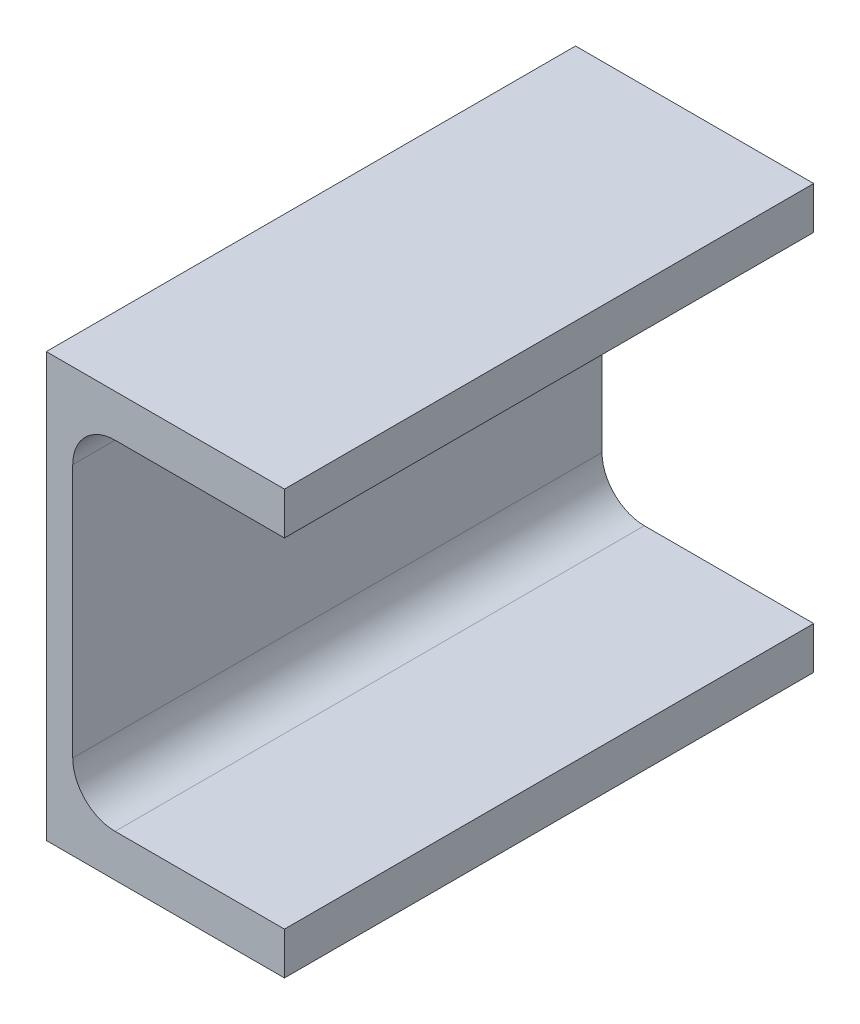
ISO-10303-21;
HEADER;
FILE_DESCRIPTION(('STEP AP214'),'2;1');
FILE_NAME('part.step','',(''),(''),'','','');
FILE_SCHEMA(('AUTOMOTIVE_DESIGN { 1 0 10303 214 1 1 1 1 }'));
ENDSEC;
DATA;
#1=APPLICATION_CONTEXT('core data for automotive mechanical design processes');
#2=APPLICATION_PROTOCOL_DEFINITION('international standard','automotive_design',2000,#1);
#3=PRODUCT_CONTEXT('',#1,'mechanical');
#4=PRODUCT('Part','Part','',(#3));
#5=PRODUCT_RELATED_PRODUCT_CATEGORY('part','',(#4));
#6=PRODUCT_DEFINITION_FORMATION('','',#4);
#7=PRODUCT_DEFINITION_CONTEXT('part definition',#1,'design');
#8=PRODUCT_DEFINITION('design','',#6,#7);
#9=PRODUCT_DEFINITION_SHAPE('','',#8);
#10=(LENGTH_UNIT() NAMED_UNIT(*) SI_UNIT(.MILLI.,.METRE.));
#11=(NAMED_UNIT(*) PLANE_ANGLE_UNIT() SI_UNIT($,.RADIAN.));
#12=(NAMED_UNIT(*) SI_UNIT($,.STERADIAN.) SOLID_ANGLE_UNIT());
#13=UNCERTAINTY_MEASURE_WITH_UNIT(LENGTH_MEASURE(1.E-05),#10,'distance_accuracy_value','');
#14=(GEOMETRIC_REPRESENTATION_CONTEXT(3) GLOBAL_UNCERTAINTY_ASSIGNED_CONTEXT((#13)) GLOBAL_UNIT_ASSIGNED_CONTEXT((#10,
#11,#12)) REPRESENTATION_CONTEXT('',''));
#15=CARTESIAN_POINT('',(0.,0.,0.));
#16=DIRECTION('',(0.,0.,1.));
#17=DIRECTION('',(1.,0.,0.));
#18=AXIS2_PLACEMENT_3D('',#15,#16,#17);
#19=CARTESIAN_POINT('',(0.,40.,50.));
#20=DIRECTION('',(1.,0.,0.));
#21=DIRECTION('',(0.,1.,0.));
#22=AXIS2_PLACEMENT_3D('',#19,#20,#21);
#23=PLANE('',#22);
#24=DIRECTION('',(0.,-1.,0.));
#25=VECTOR('',#24,1.);
#26=CARTESIAN_POINT('',(0.,40.,-50.));
#27=LINE('',#26,#25);
#28=CARTESIAN_POINT('',(0.,40.,-50.));
#29=VERTEX_POINT('',#28);
#30=CARTESIAN_POINT('',(0.,-40.,-50.));
#31=VERTEX_POINT('',#30);
#32=EDGE_CURVE('E140',#29,#31,#27,.T.);
#33=ORIENTED_EDGE('',*,*,#32,.T.);
#34=DIRECTION('',(0.,0.,-1.));
#35=VECTOR('',#34,1.);
#36=CARTESIAN_POINT('',(0.,-40.,50.));
#37=LINE('',#36,#35);
#38=CARTESIAN_POINT('',(0.,-40.,50.));
#39=VERTEX_POINT('',#38);
#40=EDGE_CURVE('E11',#39,#31,#37,.T.);
#41=ORIENTED_EDGE('',*,*,#40,.F.);
#42=DIRECTION('',(0.,-1.,0.));
#43=VECTOR('',#42,1.);
#44=CARTESIAN_POINT('',(0.,40.,50.));
#45=LINE('',#44,#43);
#46=CARTESIAN_POINT('',(0.,40.,50.));
#47=VERTEX_POINT('',#46);
#48=EDGE_CURVE('E158',#47,#39,#45,.T.);
#49=ORIENTED_EDGE('',*,*,#48,.F.);
#50=DIRECTION('',(0.,0.,-1.));
#51=VECTOR('',#50,1.);
#52=CARTESIAN_POINT('',(0.,40.,50.));
#53=LINE('',#52,#51);
#54=EDGE_CURVE('E136',#47,#29,#53,.T.);
#55=ORIENTED_EDGE('',*,*,#54,.T.);
#56=EDGE_LOOP('',(#33,#41,#49,#55));
#57=FACE_BOUND('',#56,.T.);
#58=ADVANCED_FACE('F32',(#57),#23,.F.);
#59=CARTESIAN_POINT('',(45.,-40.,50.));
#60=DIRECTION('',(0.,1.,0.));
#61=DIRECTION('',(-1.,0.,0.));
#62=AXIS2_PLACEMENT_3D('',#59,#60,#61);
#63=PLANE('',#62);
#64=DIRECTION('',(1.,0.,0.));
#65=VECTOR('',#64,1.);
#66=CARTESIAN_POINT('',(45.,-40.,-50.));
#67=LINE('',#66,#65);
#68=CARTESIAN_POINT('',(45.,-40.,-50.));
#69=VERTEX_POINT('',#68);
#70=EDGE_CURVE('E143',#31,#69,#67,.T.);
#71=ORIENTED_EDGE('',*,*,#70,.T.);
#72=DIRECTION('',(0.,0.,-1.));
#73=VECTOR('',#72,1.);
#74=CARTESIAN_POINT('',(45.,-40.,50.));
#75=LINE('',#74,#73);
#76=CARTESIAN_POINT('',(45.,-40.,50.));
#77=VERTEX_POINT('',#76);
#78=EDGE_CURVE('E40',#77,#69,#75,.T.);
#79=ORIENTED_EDGE('',*,*,#78,.F.);
#80=DIRECTION('',(1.,0.,0.));
#81=VECTOR('',#80,1.);
#82=CARTESIAN_POINT('',(45.,-40.,50.));
#83=LINE('',#82,#81);
#84=EDGE_CURVE('E97',#39,#77,#83,.T.);
#85=ORIENTED_EDGE('',*,*,#84,.F.);
#86=ORIENTED_EDGE('',*,*,#40,.T.);
#87=EDGE_LOOP('',(#71,#79,#85,#86));
#88=FACE_BOUND('',#87,.T.);
#89=ADVANCED_FACE('F207',(#88),#63,.F.);
#90=CARTESIAN_POINT('',(45.,-32.,50.));
#91=DIRECTION('',(-1.,0.,0.));
#92=DIRECTION('',(0.,-1.,0.));
#93=AXIS2_PLACEMENT_3D('',#90,#91,#92);
#94=PLANE('',#93);
#95=DIRECTION('',(0.,1.,0.));
#96=VECTOR('',#95,1.);
#97=CARTESIAN_POINT('',(45.,-32.,-50.));
#98=LINE('',#97,#96);
#99=CARTESIAN_POINT('',(45.,-32.,-50.));
#100=VERTEX_POINT('',#99);
#101=EDGE_CURVE('E145',#69,#100,#98,.T.);
#102=ORIENTED_EDGE('',*,*,#101,.T.);
#103=DIRECTION('',(0.,0.,-1.));
#104=VECTOR('',#103,1.);
#105=CARTESIAN_POINT('',(45.,-32.,50.));
#106=LINE('',#105,#104);
#107=CARTESIAN_POINT('',(45.,-32.,50.));
#108=VERTEX_POINT('',#107);
#109=EDGE_CURVE('E171',#108,#100,#106,.T.);
#110=ORIENTED_EDGE('',*,*,#109,.F.);
#111=DIRECTION('',(0.,1.,0.));
#112=VECTOR('',#111,1.);
#113=CARTESIAN_POINT('',(45.,-32.,50.));
#114=LINE('',#113,#112);
#115=EDGE_CURVE('E179',#77,#108,#114,.T.);
#116=ORIENTED_EDGE('',*,*,#115,.F.);
#117=ORIENTED_EDGE('',*,*,#78,.T.);
#118=EDGE_LOOP('',(#102,#110,#116,#117));
#119=FACE_BOUND('',#118,.T.);
#120=ADVANCED_FACE('F177',(#119),#94,.F.);
#121=CARTESIAN_POINT('',(13.,-32.,50.));
#122=DIRECTION('',(0.,-1.,0.));
#123=DIRECTION('',(0.,0.,-1.));
#124=AXIS2_PLACEMENT_3D('',#121,#122,#123);
#125=PLANE('',#124);
#126=DIRECTION('',(-1.,0.,0.));
#127=VECTOR('',#126,1.);
#128=CARTESIAN_POINT('',(13.,-32.,-50.));
#129=LINE('',#128,#127);
#130=CARTESIAN_POINT('',(13.,-32.,-50.));
#131=VERTEX_POINT('',#130);
#132=EDGE_CURVE('E147',#100,#131,#129,.T.);
#133=ORIENTED_EDGE('',*,*,#132,.T.);
#134=DIRECTION('',(0.,0.,-1.));
#135=VECTOR('',#134,1.);
#136=CARTESIAN_POINT('',(13.,-32.,50.));
#137=LINE('',#136,#135);
#138=CARTESIAN_POINT('',(13.,-32.,50.));
#139=VERTEX_POINT('',#138);
#140=EDGE_CURVE('E168',#139,#131,#137,.T.);
#141=ORIENTED_EDGE('',*,*,#140,.F.);
#142=DIRECTION('',(-1.,0.,0.));
#143=VECTOR('',#142,1.);
#144=CARTESIAN_POINT('',(13.,-32.,50.));
#145=LINE('',#144,#143);
#146=EDGE_CURVE('E197',#108,#139,#145,.T.);
#147=ORIENTED_EDGE('',*,*,#146,.F.);
#148=ORIENTED_EDGE('',*,*,#109,.T.);
#149=EDGE_LOOP('',(#133,#141,#147,#148));
#150=FACE_BOUND('',#149,.T.);
#151=ADVANCED_FACE('F188',(#150),#125,.F.);
#152=CARTESIAN_POINT('',(13.,-24.,50.));
#153=DIRECTION('',(0.,0.,-1.));
#154=DIRECTION('',(-1.,0.,0.));
#155=AXIS2_PLACEMENT_3D('',#152,#153,#154);
#156=CYLINDRICAL_SURFACE('',#155,8.);
#157=CARTESIAN_POINT('',(13.,-24.,-50.));
#158=DIRECTION('',(0.,0.,-1.));
#159=DIRECTION('',(1.,0.,0.));
#160=AXIS2_PLACEMENT_3D('',#157,#158,#159);
#161=CIRCLE('',#160,8.);
#162=CARTESIAN_POINT('',(5.00000000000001,-24.,-50.));
#163=VERTEX_POINT('',#162);
#164=EDGE_CURVE('E149',#131,#163,#161,.T.);
#165=ORIENTED_EDGE('',*,*,#164,.T.);
#166=DIRECTION('',(0.,0.,-1.));
#167=VECTOR('',#166,1.);
#168=CARTESIAN_POINT('',(5.00000000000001,-24.,50.));
#169=LINE('',#168,#167);
#170=CARTESIAN_POINT('',(5.00000000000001,-24.,50.));
#171=VERTEX_POINT('',#170);
#172=EDGE_CURVE('E165',#171,#163,#169,.T.);
#173=ORIENTED_EDGE('',*,*,#172,.F.);
#174=CARTESIAN_POINT('',(13.,-24.,50.));
#175=DIRECTION('',(0.,0.,-1.));
#176=DIRECTION('',(1.,0.,0.));
#177=AXIS2_PLACEMENT_3D('',#174,#175,#176);
#178=CIRCLE('',#177,8.);
#179=EDGE_CURVE('E194',#139,#171,#178,.T.);
#180=ORIENTED_EDGE('',*,*,#179,.F.);
#181=ORIENTED_EDGE('',*,*,#140,.T.);
#182=EDGE_LOOP('',(#165,#173,#180,#181));
#183=FACE_BOUND('',#182,.T.);
#184=ADVANCED_FACE('F192',(#183),#156,.F.);
#185=CARTESIAN_POINT('',(4.99999999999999,24.,50.));
#186=DIRECTION('',(-1.,0.,0.));
#187=DIRECTION('',(0.,-1.,0.));
#188=AXIS2_PLACEMENT_3D('',#185,#186,#187);
#189=PLANE('',#188);
#190=DIRECTION('',(0.,1.,0.));
#191=VECTOR('',#190,1.);
#192=CARTESIAN_POINT('',(4.99999999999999,24.,-50.));
#193=LINE('',#192,#191);
#194=CARTESIAN_POINT('',(4.99999999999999,24.,-50.));
#195=VERTEX_POINT('',#194);
#196=EDGE_CURVE('E151',#163,#195,#193,.T.);
#197=ORIENTED_EDGE('',*,*,#196,.T.);
#198=DIRECTION('',(0.,0.,-1.));
#199=VECTOR('',#198,1.);
#200=CARTESIAN_POINT('',(4.99999999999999,24.,50.));
#201=LINE('',#200,#199);
#202=CARTESIAN_POINT('',(4.99999999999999,24.,50.));
#203=VERTEX_POINT('',#202);
#204=EDGE_CURVE('E162',#203,#195,#201,.T.);
#205=ORIENTED_EDGE('',*,*,#204,.F.);
#206=DIRECTION('',(0.,1.,0.));
#207=VECTOR('',#206,1.);
#208=CARTESIAN_POINT('',(4.99999999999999,24.,50.));
#209=LINE('',#208,#207);
#210=EDGE_CURVE('E196',#171,#203,#209,.T.);
#211=ORIENTED_EDGE('',*,*,#210,.F.);
#212=ORIENTED_EDGE('',*,*,#172,.T.);
#213=EDGE_LOOP('',(#197,#205,#211,#212));
#214=FACE_BOUND('',#213,.T.);
#215=ADVANCED_FACE('F219',(#214),#189,.F.);
#216=CARTESIAN_POINT('',(13.,24.,50.));
#217=DIRECTION('',(0.,0.,-1.));
#218=DIRECTION('',(-1.,0.,0.));
#219=AXIS2_PLACEMENT_3D('',#216,#217,#218);
#220=CYLINDRICAL_SURFACE('',#219,8.);
#221=CARTESIAN_POINT('',(13.,24.,-50.));
#222=DIRECTION('',(0.,0.,-1.));
#223=DIRECTION('',(-1.,0.,0.));
#224=AXIS2_PLACEMENT_3D('',#221,#222,#223);
#225=CIRCLE('',#224,8.);
#226=CARTESIAN_POINT('',(13.,32.,-50.));
#227=VERTEX_POINT('',#226);
#228=EDGE_CURVE('E153',#195,#227,#225,.T.);
#229=ORIENTED_EDGE('',*,*,#228,.T.);
#230=DIRECTION('',(0.,0.,-1.));
#231=VECTOR('',#230,1.);
#232=CARTESIAN_POINT('',(13.,32.,50.));
#233=LINE('',#232,#231);
#234=CARTESIAN_POINT('',(13.,32.,50.));
#235=VERTEX_POINT('',#234);
#236=EDGE_CURVE('E131',#235,#227,#233,.T.);
#237=ORIENTED_EDGE('',*,*,#236,.F.);
#238=CARTESIAN_POINT('',(13.,24.,50.));
#239=DIRECTION('',(0.,0.,-1.));
#240=DIRECTION('',(-1.,0.,0.));
#241=AXIS2_PLACEMENT_3D('',#238,#239,#240);
#242=CIRCLE('',#241,8.);
#243=EDGE_CURVE('E122',#203,#235,#242,.T.);
#244=ORIENTED_EDGE('',*,*,#243,.F.);
#245=ORIENTED_EDGE('',*,*,#204,.T.);
#246=EDGE_LOOP('',(#229,#237,#244,#245));
#247=FACE_BOUND('',#246,.T.);
#248=ADVANCED_FACE('F222',(#247),#220,.F.);
#249=CARTESIAN_POINT('',(13.,32.,50.));
#250=DIRECTION('',(0.,1.,0.));
#251=DIRECTION('',(-1.,0.,0.));
#252=AXIS2_PLACEMENT_3D('',#249,#250,#251);
#253=PLANE('',#252);
#254=DIRECTION('',(1.,0.,0.));
#255=VECTOR('',#254,1.);
#256=CARTESIAN_POINT('',(13.,32.,-50.));
#257=LINE('',#256,#255);
#258=CARTESIAN_POINT('',(45.,32.,-50.));
#259=VERTEX_POINT('',#258);
#260=EDGE_CURVE('E130',#227,#259,#257,.T.);
#261=ORIENTED_EDGE('',*,*,#260,.T.);
#262=DIRECTION('',(0.,0.,-1.));
#263=VECTOR('',#262,1.);
#264=CARTESIAN_POINT('',(45.,32.,50.));
#265=LINE('',#264,#263);
#266=CARTESIAN_POINT('',(45.,32.,50.));
#267=VERTEX_POINT('',#266);
#268=EDGE_CURVE('E127',#267,#259,#265,.T.);
#269=ORIENTED_EDGE('',*,*,#268,.F.);
#270=DIRECTION('',(1.,0.,0.));
#271=VECTOR('',#270,1.);
#272=CARTESIAN_POINT('',(13.,32.,50.));
#273=LINE('',#272,#271);
#274=EDGE_CURVE('E116',#235,#267,#273,.T.);
#275=ORIENTED_EDGE('',*,*,#274,.F.);
#276=ORIENTED_EDGE('',*,*,#236,.T.);
#277=EDGE_LOOP('',(#261,#269,#275,#276));
#278=FACE_BOUND('',#277,.T.);
#279=ADVANCED_FACE('F128',(#278),#253,.F.);
#280=CARTESIAN_POINT('',(45.,40.,50.));
#281=DIRECTION('',(-1.,0.,0.));
#282=DIRECTION('',(0.,0.,1.));
#283=AXIS2_PLACEMENT_3D('',#280,#281,#282);
#284=PLANE('',#283);
#285=DIRECTION('',(0.,1.,0.));
#286=VECTOR('',#285,1.);
#287=CARTESIAN_POINT('',(45.,40.,-50.));
#288=LINE('',#287,#286);
#289=CARTESIAN_POINT('',(45.,40.,-50.));
#290=VERTEX_POINT('',#289);
#291=EDGE_CURVE('E83',#259,#290,#288,.T.);
#292=ORIENTED_EDGE('',*,*,#291,.T.);
#293=DIRECTION('',(0.,0.,-1.));
#294=VECTOR('',#293,1.);
#295=CARTESIAN_POINT('',(45.,40.,50.));
#296=LINE('',#295,#294);
#297=CARTESIAN_POINT('',(45.,40.,50.));
#298=VERTEX_POINT('',#297);
#299=EDGE_CURVE('E132',#298,#290,#296,.T.);
#300=ORIENTED_EDGE('',*,*,#299,.F.);
#301=DIRECTION('',(0.,1.,0.));
#302=VECTOR('',#301,1.);
#303=CARTESIAN_POINT('',(45.,40.,50.));
#304=LINE('',#303,#302);
#305=EDGE_CURVE('E120',#267,#298,#304,.T.);
#306=ORIENTED_EDGE('',*,*,#305,.F.);
#307=ORIENTED_EDGE('',*,*,#268,.T.);
#308=EDGE_LOOP('',(#292,#300,#306,#307));
#309=FACE_BOUND('',#308,.T.);
#310=ADVANCED_FACE('F134',(#309),#284,.F.);
#311=CARTESIAN_POINT('',(45.,40.,50.));
#312=DIRECTION('',(0.,-1.,0.));
#313=DIRECTION('',(1.,0.,0.));
#314=AXIS2_PLACEMENT_3D('',#311,#312,#313);
#315=PLANE('',#314);
#316=DIRECTION('',(-1.,0.,0.));
#317=VECTOR('',#316,1.);
#318=CARTESIAN_POINT('',(45.,40.,-50.));
#319=LINE('',#318,#317);
#320=EDGE_CURVE('E89',#290,#29,#319,.T.);
#321=ORIENTED_EDGE('',*,*,#320,.T.);
#322=ORIENTED_EDGE('',*,*,#54,.F.);
#323=DIRECTION('',(-1.,0.,0.));
#324=VECTOR('',#323,1.);
#325=CARTESIAN_POINT('',(45.,40.,50.));
#326=LINE('',#325,#324);
#327=EDGE_CURVE('E48',#298,#47,#326,.T.);
#328=ORIENTED_EDGE('',*,*,#327,.F.);
#329=ORIENTED_EDGE('',*,*,#299,.T.);
#330=EDGE_LOOP('',(#321,#322,#328,#329));
#331=FACE_BOUND('',#330,.T.);
#332=ADVANCED_FACE('F231',(#331),#315,.F.);
#333=CARTESIAN_POINT('',(13.,-24.,50.));
#334=DIRECTION('',(0.,0.,1.));
#335=DIRECTION('',(1.,0.,0.));
#336=AXIS2_PLACEMENT_3D('',#333,#334,#335);
#337=PLANE('',#336);
#338=ORIENTED_EDGE('',*,*,#48,.T.);
#339=ORIENTED_EDGE('',*,*,#84,.T.);
#340=ORIENTED_EDGE('',*,*,#115,.T.);
#341=ORIENTED_EDGE('',*,*,#146,.T.);
#342=ORIENTED_EDGE('',*,*,#179,.T.);
#343=ORIENTED_EDGE('',*,*,#210,.T.);
#344=ORIENTED_EDGE('',*,*,#243,.T.);
#345=ORIENTED_EDGE('',*,*,#274,.T.);
#346=ORIENTED_EDGE('',*,*,#305,.T.);
#347=ORIENTED_EDGE('',*,*,#327,.T.);
#348=EDGE_LOOP('',(#338,#339,#340,#341,#342,#343,#344,#345,#346,#347));
#349=FACE_BOUND('',#348,.T.);
#350=ADVANCED_FACE('F118',(#349),#337,.T.);
#351=CARTESIAN_POINT('',(13.,-24.,-50.));
#352=DIRECTION('',(0.,0.,1.));
#353=DIRECTION('',(1.,0.,0.));
#354=AXIS2_PLACEMENT_3D('',#351,#352,#353);
#355=PLANE('',#354);
#356=ORIENTED_EDGE('',*,*,#32,.F.);
#357=ORIENTED_EDGE('',*,*,#320,.F.);
#358=ORIENTED_EDGE('',*,*,#291,.F.);
#359=ORIENTED_EDGE('',*,*,#260,.F.);
#360=ORIENTED_EDGE('',*,*,#228,.F.);
#361=ORIENTED_EDGE('',*,*,#196,.F.);
#362=ORIENTED_EDGE('',*,*,#164,.F.);
#363=ORIENTED_EDGE('',*,*,#132,.F.);
#364=ORIENTED_EDGE('',*,*,#101,.F.);
#365=ORIENTED_EDGE('',*,*,#70,.F.);
#366=EDGE_LOOP('',(#356,#357,#358,#359,#360,#361,#362,#363,#364,#365));
#367=FACE_BOUND('',#366,.T.);
#368=ADVANCED_FACE('F183',(#367),#355,.F.);
#369=CLOSED_SHELL('',(#58,#89,#120,#151,#184,#215,#248,#279,#310,#332,#350,#368));
#370=MANIFOLD_SOLID_BREP('B2',#369);
#371=ADVANCED_BREP_SHAPE_REPRESENTATION('',(#18,#370),#14);
#372=SHAPE_DEFINITION_REPRESENTATION(#9,#371);
ENDSEC;
END-ISO-10303-21;
